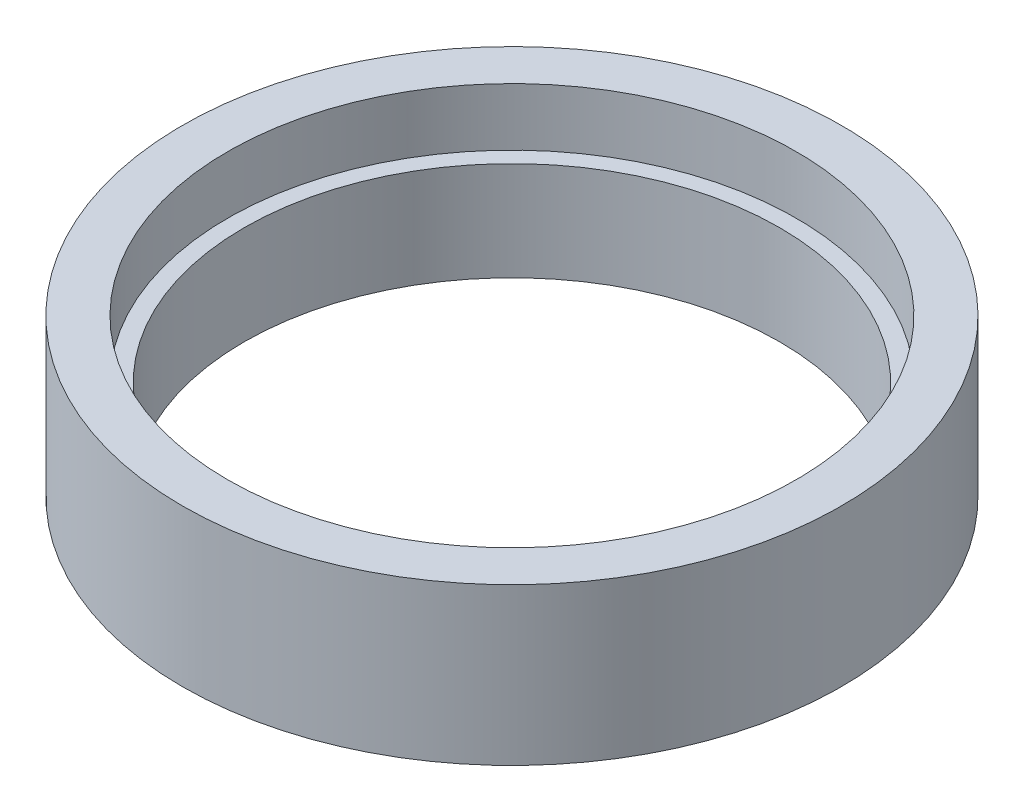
ISO-10303-21;
HEADER;
FILE_DESCRIPTION(('STEP AP214'),'2;1');
FILE_NAME('part.step','',(''),(''),'','','');
FILE_SCHEMA(('AUTOMOTIVE_DESIGN { 1 0 10303 214 1 1 1 1 }'));
ENDSEC;
DATA;
#1=APPLICATION_CONTEXT('core data for automotive mechanical design processes');
#2=APPLICATION_PROTOCOL_DEFINITION('international standard','automotive_design',2000,#1);
#3=PRODUCT_CONTEXT('',#1,'mechanical');
#4=PRODUCT('Part','Part','',(#3));
#5=PRODUCT_RELATED_PRODUCT_CATEGORY('part','',(#4));
#6=PRODUCT_DEFINITION_FORMATION('','',#4);
#7=PRODUCT_DEFINITION_CONTEXT('part definition',#1,'design');
#8=PRODUCT_DEFINITION('design','',#6,#7);
#9=PRODUCT_DEFINITION_SHAPE('','',#8);
#10=(LENGTH_UNIT() NAMED_UNIT(*) SI_UNIT(.MILLI.,.METRE.));
#11=(NAMED_UNIT(*) PLANE_ANGLE_UNIT() SI_UNIT($,.RADIAN.));
#12=(NAMED_UNIT(*) SI_UNIT($,.STERADIAN.) SOLID_ANGLE_UNIT());
#13=UNCERTAINTY_MEASURE_WITH_UNIT(LENGTH_MEASURE(1.E-05),#10,'distance_accuracy_value','');
#14=(GEOMETRIC_REPRESENTATION_CONTEXT(3) GLOBAL_UNCERTAINTY_ASSIGNED_CONTEXT((#13)) GLOBAL_UNIT_ASSIGNED_CONTEXT((#10,
#11,#12)) REPRESENTATION_CONTEXT('',''));
#15=CARTESIAN_POINT('',(0.,0.,0.));
#16=DIRECTION('',(0.,0.,1.));
#17=DIRECTION('',(1.,0.,0.));
#18=AXIS2_PLACEMENT_3D('',#15,#16,#17);
#19=CARTESIAN_POINT('',(0.,0.,0.));
#20=DIRECTION('',(0.,1.,0.));
#21=DIRECTION('',(0.,0.,1.));
#22=AXIS2_PLACEMENT_3D('',#19,#20,#21);
#23=CYLINDRICAL_SURFACE('',#22,32.5);
#24=CARTESIAN_POINT('',(0.,0.,0.));
#25=DIRECTION('',(0.,1.,0.));
#26=DIRECTION('',(0.,0.,1.));
#27=AXIS2_PLACEMENT_3D('',#24,#25,#26);
#28=CIRCLE('',#27,32.5);
#29=CARTESIAN_POINT('',(0.,0.,32.5));
#30=VERTEX_POINT('',#29);
#31=EDGE_CURVE('E44',#30,#30,#28,.T.);
#32=ORIENTED_EDGE('',*,*,#31,.F.);
#33=EDGE_LOOP('',(#32));
#34=FACE_BOUND('',#33,.T.);
#35=CARTESIAN_POINT('',(0.,12.,0.));
#36=DIRECTION('',(0.,1.,0.));
#37=DIRECTION('',(0.,0.,1.));
#38=AXIS2_PLACEMENT_3D('',#35,#36,#37);
#39=CIRCLE('',#38,32.5);
#40=CARTESIAN_POINT('',(0.,12.,32.5));
#41=VERTEX_POINT('',#40);
#42=EDGE_CURVE('E35',#41,#41,#39,.F.);
#43=ORIENTED_EDGE('',*,*,#42,.F.);
#44=EDGE_LOOP('',(#43));
#45=FACE_BOUND('',#44,.T.);
#46=ADVANCED_FACE('F31',(#34,#45),#23,.F.);
#47=CARTESIAN_POINT('',(0.,19.,0.));
#48=DIRECTION('',(0.,-1.,0.));
#49=DIRECTION('',(0.,0.,-1.));
#50=AXIS2_PLACEMENT_3D('',#47,#48,#49);
#51=CYLINDRICAL_SURFACE('',#50,40.);
#52=CARTESIAN_POINT('',(0.,19.,0.));
#53=DIRECTION('',(0.,1.,0.));
#54=DIRECTION('',(0.,0.,1.));
#55=AXIS2_PLACEMENT_3D('',#52,#53,#54);
#56=CIRCLE('',#55,40.);
#57=CARTESIAN_POINT('',(0.,19.,40.));
#58=VERTEX_POINT('',#57);
#59=EDGE_CURVE('E10',#58,#58,#56,.T.);
#60=ORIENTED_EDGE('',*,*,#59,.F.);
#61=EDGE_LOOP('',(#60));
#62=FACE_BOUND('',#61,.T.);
#63=CARTESIAN_POINT('',(0.,0.,0.));
#64=DIRECTION('',(0.,1.,0.));
#65=DIRECTION('',(0.,0.,1.));
#66=AXIS2_PLACEMENT_3D('',#63,#64,#65);
#67=CIRCLE('',#66,40.);
#68=CARTESIAN_POINT('',(0.,0.,40.));
#69=VERTEX_POINT('',#68);
#70=EDGE_CURVE('E39',#69,#69,#67,.T.);
#71=ORIENTED_EDGE('',*,*,#70,.T.);
#72=EDGE_LOOP('',(#71));
#73=FACE_BOUND('',#72,.T.);
#74=ADVANCED_FACE('F33',(#62,#73),#51,.T.);
#75=CARTESIAN_POINT('',(0.,19.,0.));
#76=DIRECTION('',(0.,1.,0.));
#77=DIRECTION('',(0.,0.,1.));
#78=AXIS2_PLACEMENT_3D('',#75,#76,#77);
#79=PLANE('',#78);
#80=CARTESIAN_POINT('',(0.,19.,0.));
#81=DIRECTION('',(0.,1.,0.));
#82=DIRECTION('',(0.,0.,1.));
#83=AXIS2_PLACEMENT_3D('',#80,#81,#82);
#84=CIRCLE('',#83,34.5);
#85=CARTESIAN_POINT('',(0.,19.,34.5));
#86=VERTEX_POINT('',#85);
#87=EDGE_CURVE('E48',#86,#86,#84,.T.);
#88=ORIENTED_EDGE('',*,*,#87,.F.);
#89=EDGE_LOOP('',(#88));
#90=FACE_BOUND('',#89,.T.);
#91=ORIENTED_EDGE('',*,*,#59,.T.);
#92=EDGE_LOOP('',(#91));
#93=FACE_BOUND('',#92,.T.);
#94=ADVANCED_FACE('F66',(#90,#93),#79,.T.);
#95=CARTESIAN_POINT('',(0.,0.,0.));
#96=DIRECTION('',(0.,1.,0.));
#97=DIRECTION('',(0.,0.,1.));
#98=AXIS2_PLACEMENT_3D('',#95,#96,#97);
#99=PLANE('',#98);
#100=ORIENTED_EDGE('',*,*,#31,.T.);
#101=EDGE_LOOP('',(#100));
#102=FACE_BOUND('',#101,.T.);
#103=ORIENTED_EDGE('',*,*,#70,.F.);
#104=EDGE_LOOP('',(#103));
#105=FACE_BOUND('',#104,.T.);
#106=ADVANCED_FACE('F74',(#102,#105),#99,.F.);
#107=CARTESIAN_POINT('',(0.,12.,0.));
#108=DIRECTION('',(0.,1.,0.));
#109=DIRECTION('',(0.,0.,1.));
#110=AXIS2_PLACEMENT_3D('',#107,#108,#109);
#111=PLANE('',#110);
#112=CARTESIAN_POINT('',(0.,12.,0.));
#113=DIRECTION('',(0.,1.,0.));
#114=DIRECTION('',(0.,0.,1.));
#115=AXIS2_PLACEMENT_3D('',#112,#113,#114);
#116=CIRCLE('',#115,34.5);
#117=CARTESIAN_POINT('',(0.,12.,34.5));
#118=VERTEX_POINT('',#117);
#119=EDGE_CURVE('E51',#118,#118,#116,.T.);
#120=ORIENTED_EDGE('',*,*,#119,.T.);
#121=EDGE_LOOP('',(#120));
#122=FACE_BOUND('',#121,.T.);
#123=ORIENTED_EDGE('',*,*,#42,.T.);
#124=EDGE_LOOP('',(#123));
#125=FACE_BOUND('',#124,.T.);
#126=ADVANCED_FACE('F58',(#122,#125),#111,.T.);
#127=CARTESIAN_POINT('',(0.,12.,0.));
#128=DIRECTION('',(0.,1.,0.));
#129=DIRECTION('',(0.,0.,1.));
#130=AXIS2_PLACEMENT_3D('',#127,#128,#129);
#131=CYLINDRICAL_SURFACE('',#130,34.5);
#132=ORIENTED_EDGE('',*,*,#119,.F.);
#133=EDGE_LOOP('',(#132));
#134=FACE_BOUND('',#133,.T.);
#135=ORIENTED_EDGE('',*,*,#87,.T.);
#136=EDGE_LOOP('',(#135));
#137=FACE_BOUND('',#136,.T.);
#138=ADVANCED_FACE('F71',(#134,#137),#131,.F.);
#139=CLOSED_SHELL('',(#46,#74,#94,#106,#126,#138));
#140=MANIFOLD_SOLID_BREP('B2',#139);
#141=ADVANCED_BREP_SHAPE_REPRESENTATION('',(#18,#140),#14);
#142=SHAPE_DEFINITION_REPRESENTATION(#9,#141);
ENDSEC;
END-ISO-10303-21;
